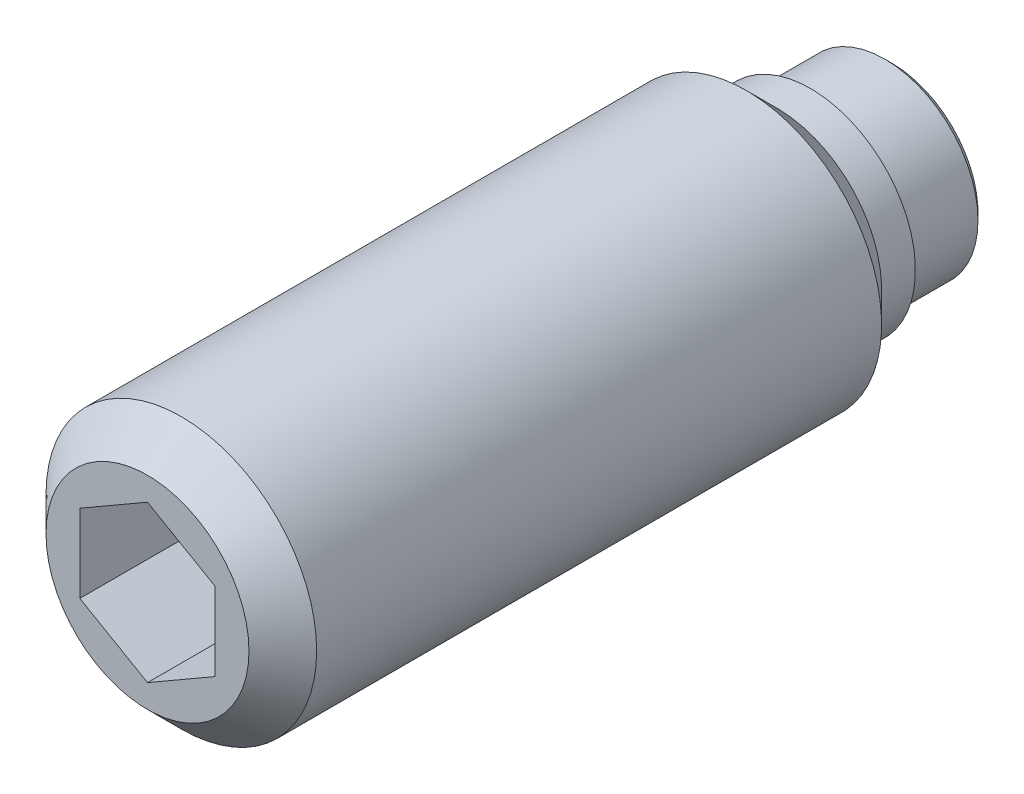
ISO-10303-21;
HEADER;
FILE_DESCRIPTION(('STEP AP214'),'2;1');
FILE_NAME('part.step','',(''),(''),'','','');
FILE_SCHEMA(('AUTOMOTIVE_DESIGN { 1 0 10303 214 1 1 1 1 }'));
ENDSEC;
DATA;
#1=APPLICATION_CONTEXT('core data for automotive mechanical design processes');
#2=APPLICATION_PROTOCOL_DEFINITION('international standard','automotive_design',2000,#1);
#3=PRODUCT_CONTEXT('',#1,'mechanical');
#4=PRODUCT('Part','Part','',(#3));
#5=PRODUCT_RELATED_PRODUCT_CATEGORY('part','',(#4));
#6=PRODUCT_DEFINITION_FORMATION('','',#4);
#7=PRODUCT_DEFINITION_CONTEXT('part definition',#1,'design');
#8=PRODUCT_DEFINITION('design','',#6,#7);
#9=PRODUCT_DEFINITION_SHAPE('','',#8);
#10=(LENGTH_UNIT() NAMED_UNIT(*) SI_UNIT(.MILLI.,.METRE.));
#11=(NAMED_UNIT(*) PLANE_ANGLE_UNIT() SI_UNIT($,.RADIAN.));
#12=(NAMED_UNIT(*) SI_UNIT($,.STERADIAN.) SOLID_ANGLE_UNIT());
#13=UNCERTAINTY_MEASURE_WITH_UNIT(LENGTH_MEASURE(1.E-05),#10,'distance_accuracy_value','');
#14=(GEOMETRIC_REPRESENTATION_CONTEXT(3) GLOBAL_UNCERTAINTY_ASSIGNED_CONTEXT((#13)) GLOBAL_UNIT_ASSIGNED_CONTEXT((#10,
#11,#12)) REPRESENTATION_CONTEXT('',''));
#15=CARTESIAN_POINT('',(0.,0.,0.));
#16=DIRECTION('',(0.,0.,1.));
#17=DIRECTION('',(1.,0.,0.));
#18=AXIS2_PLACEMENT_3D('',#15,#16,#17);
#19=CARTESIAN_POINT('',(0.,3.1,2.4));
#20=DIRECTION('',(0.,0.,1.));
#21=DIRECTION('',(1.,0.,0.));
#22=AXIS2_PLACEMENT_3D('',#19,#20,#21);
#23=PLANE('',#22);
#24=CARTESIAN_POINT('',(0.,0.,2.4));
#25=DIRECTION('',(0.,0.,-1.));
#26=DIRECTION('',(-1.,0.,0.));
#27=AXIS2_PLACEMENT_3D('',#24,#25,#26);
#28=CIRCLE('',#27,2.75);
#29=CARTESIAN_POINT('',(-2.75,0.,2.4));
#30=VERTEX_POINT('',#29);
#31=EDGE_CURVE('E130',#30,#30,#28,.T.);
#32=ORIENTED_EDGE('',*,*,#31,.F.);
#33=EDGE_LOOP('',(#32));
#34=FACE_BOUND('',#33,.T.);
#35=CARTESIAN_POINT('',(0.,0.,2.4));
#36=DIRECTION('',(0.,0.,-1.));
#37=DIRECTION('',(-1.,0.,0.));
#38=AXIS2_PLACEMENT_3D('',#35,#36,#37);
#39=CIRCLE('',#38,3.1);
#40=CARTESIAN_POINT('',(-3.1,0.,2.4));
#41=VERTEX_POINT('',#40);
#42=EDGE_CURVE('E133',#41,#41,#39,.T.);
#43=ORIENTED_EDGE('',*,*,#42,.T.);
#44=EDGE_LOOP('',(#43));
#45=FACE_BOUND('',#44,.T.);
#46=ADVANCED_FACE('F14',(#34,#45),#23,.F.);
#47=CARTESIAN_POINT('',(0.,0.,2.4));
#48=DIRECTION('',(0.,0.,-1.));
#49=DIRECTION('',(-1.,0.,0.));
#50=AXIS2_PLACEMENT_3D('',#47,#48,#49);
#51=CYLINDRICAL_SURFACE('',#50,4.);
#52=CARTESIAN_POINT('',(0.,0.,21.));
#53=DIRECTION('',(0.,0.,1.));
#54=DIRECTION('',(1.,0.,0.));
#55=AXIS2_PLACEMENT_3D('',#52,#53,#54);
#56=CIRCLE('',#55,4.);
#57=CARTESIAN_POINT('',(4.,0.,21.));
#58=VERTEX_POINT('',#57);
#59=EDGE_CURVE('E9',#58,#58,#56,.F.);
#60=ORIENTED_EDGE('',*,*,#59,.T.);
#61=EDGE_LOOP('',(#60));
#62=FACE_BOUND('',#61,.T.);
#63=CARTESIAN_POINT('',(0.,0.,4.3));
#64=DIRECTION('',(0.,0.,-1.));
#65=DIRECTION('',(-1.,0.,0.));
#66=AXIS2_PLACEMENT_3D('',#63,#64,#65);
#67=CIRCLE('',#66,4.);
#68=CARTESIAN_POINT('',(-4.,0.,4.3));
#69=VERTEX_POINT('',#68);
#70=EDGE_CURVE('E139',#69,#69,#67,.T.);
#71=ORIENTED_EDGE('',*,*,#70,.F.);
#72=EDGE_LOOP('',(#71));
#73=FACE_BOUND('',#72,.T.);
#74=ADVANCED_FACE('F157',(#62,#73),#51,.T.);
#75=CARTESIAN_POINT('',(0.,0.,4.3));
#76=DIRECTION('',(0.,0.,1.));
#77=DIRECTION('',(1.,0.,0.));
#78=AXIS2_PLACEMENT_3D('',#75,#76,#77);
#79=CONICAL_SURFACE('',#78,4.,0.785398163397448);
#80=CARTESIAN_POINT('',(0.,0.,3.4));
#81=DIRECTION('',(0.,0.,-1.));
#82=DIRECTION('',(-1.,0.,0.));
#83=AXIS2_PLACEMENT_3D('',#80,#81,#82);
#84=CIRCLE('',#83,3.1);
#85=CARTESIAN_POINT('',(-3.1,0.,3.4));
#86=VERTEX_POINT('',#85);
#87=EDGE_CURVE('E136',#86,#86,#84,.T.);
#88=ORIENTED_EDGE('',*,*,#87,.F.);
#89=EDGE_LOOP('',(#88));
#90=FACE_BOUND('',#89,.T.);
#91=ORIENTED_EDGE('',*,*,#70,.T.);
#92=EDGE_LOOP('',(#91));
#93=FACE_BOUND('',#92,.T.);
#94=ADVANCED_FACE('F164',(#90,#93),#79,.T.);
#95=CARTESIAN_POINT('',(0.,0.,2.4));
#96=DIRECTION('',(0.,0.,-1.));
#97=DIRECTION('',(-1.,0.,0.));
#98=AXIS2_PLACEMENT_3D('',#95,#96,#97);
#99=CYLINDRICAL_SURFACE('',#98,3.1);
#100=ORIENTED_EDGE('',*,*,#42,.F.);
#101=EDGE_LOOP('',(#100));
#102=FACE_BOUND('',#101,.T.);
#103=ORIENTED_EDGE('',*,*,#87,.T.);
#104=EDGE_LOOP('',(#103));
#105=FACE_BOUND('',#104,.T.);
#106=ADVANCED_FACE('F172',(#102,#105),#99,.T.);
#107=CARTESIAN_POINT('',(0.,0.,-1.));
#108=DIRECTION('',(0.,0.,-1.));
#109=DIRECTION('',(-1.,0.,0.));
#110=AXIS2_PLACEMENT_3D('',#107,#108,#109);
#111=CYLINDRICAL_SURFACE('',#110,2.75);
#112=CARTESIAN_POINT('',(0.,0.,0.2));
#113=DIRECTION('',(0.,0.,-1.));
#114=DIRECTION('',(-1.,0.,0.));
#115=AXIS2_PLACEMENT_3D('',#112,#113,#114);
#116=CIRCLE('',#115,2.75);
#117=CARTESIAN_POINT('',(-2.75,0.,0.2));
#118=VERTEX_POINT('',#117);
#119=EDGE_CURVE('E127',#118,#118,#116,.T.);
#120=ORIENTED_EDGE('',*,*,#119,.F.);
#121=EDGE_LOOP('',(#120));
#122=FACE_BOUND('',#121,.T.);
#123=ORIENTED_EDGE('',*,*,#31,.T.);
#124=EDGE_LOOP('',(#123));
#125=FACE_BOUND('',#124,.T.);
#126=ADVANCED_FACE('F170',(#122,#125),#111,.T.);
#127=CARTESIAN_POINT('',(0.,0.,0.2));
#128=DIRECTION('',(0.,0.,1.));
#129=DIRECTION('',(1.,0.,0.));
#130=AXIS2_PLACEMENT_3D('',#127,#128,#129);
#131=CONICAL_SURFACE('',#130,2.75,0.785398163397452);
#132=CARTESIAN_POINT('',(0.,0.,0.));
#133=DIRECTION('',(0.,0.,-1.));
#134=DIRECTION('',(-1.,0.,0.));
#135=AXIS2_PLACEMENT_3D('',#132,#133,#134);
#136=CIRCLE('',#135,2.55);
#137=CARTESIAN_POINT('',(-2.55,0.,0.));
#138=VERTEX_POINT('',#137);
#139=EDGE_CURVE('E124',#138,#138,#136,.T.);
#140=ORIENTED_EDGE('',*,*,#139,.F.);
#141=EDGE_LOOP('',(#140));
#142=FACE_BOUND('',#141,.T.);
#143=ORIENTED_EDGE('',*,*,#119,.T.);
#144=EDGE_LOOP('',(#143));
#145=FACE_BOUND('',#144,.T.);
#146=ADVANCED_FACE('F204',(#142,#145),#131,.T.);
#147=CARTESIAN_POINT('',(0.,2.55,0.));
#148=DIRECTION('',(0.,0.,1.));
#149=DIRECTION('',(1.,0.,0.));
#150=AXIS2_PLACEMENT_3D('',#147,#148,#149);
#151=PLANE('',#150);
#152=CARTESIAN_POINT('',(0.,0.,0.));
#153=DIRECTION('',(0.,0.,-1.));
#154=DIRECTION('',(-1.,0.,0.));
#155=AXIS2_PLACEMENT_3D('',#152,#153,#154);
#156=CIRCLE('',#155,1.);
#157=CARTESIAN_POINT('',(-1.,0.,0.));
#158=VERTEX_POINT('',#157);
#159=EDGE_CURVE('E114',#158,#158,#156,.T.);
#160=ORIENTED_EDGE('',*,*,#159,.F.);
#161=EDGE_LOOP('',(#160));
#162=FACE_BOUND('',#161,.T.);
#163=ORIENTED_EDGE('',*,*,#139,.T.);
#164=EDGE_LOOP('',(#163));
#165=FACE_BOUND('',#164,.T.);
#166=ADVANCED_FACE('F212',(#162,#165),#151,.F.);
#167=CARTESIAN_POINT('',(0.,0.,0.));
#168=DIRECTION('',(0.,0.,1.));
#169=DIRECTION('',(1.,0.,0.));
#170=AXIS2_PLACEMENT_3D('',#167,#168,#169);
#171=CONICAL_SURFACE('',#170,1.,0.785398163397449);
#172=CARTESIAN_POINT('',(0.,0.,-1.));
#173=VERTEX_POINT('',#172);
#174=VERTEX_LOOP('',#173);
#175=FACE_BOUND('',#174,.T.);
#176=ORIENTED_EDGE('',*,*,#159,.T.);
#177=EDGE_LOOP('',(#176));
#178=FACE_BOUND('',#177,.T.);
#179=ADVANCED_FACE('F220',(#175,#178),#171,.T.);
#180=CARTESIAN_POINT('',(0.,0.,22.));
#181=DIRECTION('',(0.,0.,1.));
#182=DIRECTION('',(1.,0.,0.));
#183=AXIS2_PLACEMENT_3D('',#180,#181,#182);
#184=PLANE('',#183);
#185=CARTESIAN_POINT('',(0.,0.,22.));
#186=DIRECTION('',(0.,0.,1.));
#187=DIRECTION('',(1.,0.,0.));
#188=AXIS2_PLACEMENT_3D('',#185,#186,#187);
#189=CIRCLE('',#188,3.);
#190=CARTESIAN_POINT('',(3.,0.,22.));
#191=VERTEX_POINT('',#190);
#192=EDGE_CURVE('E22',#191,#191,#189,.T.);
#193=ORIENTED_EDGE('',*,*,#192,.T.);
#194=EDGE_LOOP('',(#193));
#195=FACE_BOUND('',#194,.T.);
#196=DIRECTION('',(-0.866025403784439,0.5,0.));
#197=VECTOR('',#196,1.);
#198=CARTESIAN_POINT('',(2.,1.15470053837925,22.));
#199=LINE('',#198,#197);
#200=CARTESIAN_POINT('',(2.,1.15470053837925,22.));
#201=VERTEX_POINT('',#200);
#202=CARTESIAN_POINT('',(0.,2.30940107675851,22.));
#203=VERTEX_POINT('',#202);
#204=EDGE_CURVE('E29',#201,#203,#199,.T.);
#205=ORIENTED_EDGE('',*,*,#204,.F.);
#206=DIRECTION('',(0.,1.,0.));
#207=VECTOR('',#206,1.);
#208=CARTESIAN_POINT('',(2.,-1.15470053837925,22.));
#209=LINE('',#208,#207);
#210=CARTESIAN_POINT('',(2.,-1.15470053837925,22.));
#211=VERTEX_POINT('',#210);
#212=EDGE_CURVE('E88',#211,#201,#209,.T.);
#213=ORIENTED_EDGE('',*,*,#212,.F.);
#214=DIRECTION('',(0.866025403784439,0.5,0.));
#215=VECTOR('',#214,1.);
#216=CARTESIAN_POINT('',(0.,-2.30940107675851,22.));
#217=LINE('',#216,#215);
#218=CARTESIAN_POINT('',(0.,-2.30940107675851,22.));
#219=VERTEX_POINT('',#218);
#220=EDGE_CURVE('E91',#219,#211,#217,.T.);
#221=ORIENTED_EDGE('',*,*,#220,.F.);
#222=DIRECTION('',(0.866025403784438,-0.5,0.));
#223=VECTOR('',#222,1.);
#224=CARTESIAN_POINT('',(-2.,-1.15470053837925,22.));
#225=LINE('',#224,#223);
#226=CARTESIAN_POINT('',(-2.,-1.15470053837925,22.));
#227=VERTEX_POINT('',#226);
#228=EDGE_CURVE('E107',#227,#219,#225,.T.);
#229=ORIENTED_EDGE('',*,*,#228,.F.);
#230=DIRECTION('',(0.,-1.,0.));
#231=VECTOR('',#230,1.);
#232=CARTESIAN_POINT('',(-2.,1.15470053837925,22.));
#233=LINE('',#232,#231);
#234=CARTESIAN_POINT('',(-2.,1.15470053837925,22.));
#235=VERTEX_POINT('',#234);
#236=EDGE_CURVE('E104',#235,#227,#233,.T.);
#237=ORIENTED_EDGE('',*,*,#236,.F.);
#238=DIRECTION('',(-0.866025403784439,-0.5,0.));
#239=VECTOR('',#238,1.);
#240=CARTESIAN_POINT('',(0.,2.30940107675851,22.));
#241=LINE('',#240,#239);
#242=EDGE_CURVE('E102',#203,#235,#241,.T.);
#243=ORIENTED_EDGE('',*,*,#242,.F.);
#244=EDGE_LOOP('',(#205,#213,#221,#229,#237,#243));
#245=FACE_BOUND('',#244,.T.);
#246=ADVANCED_FACE('F144',(#195,#245),#184,.T.);
#247=CARTESIAN_POINT('',(2.,1.15470053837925,18.));
#248=DIRECTION('',(0.5,0.866025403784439,0.));
#249=DIRECTION('',(-0.866025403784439,0.5,0.));
#250=AXIS2_PLACEMENT_3D('',#247,#248,#249);
#251=PLANE('',#250);
#252=ORIENTED_EDGE('',*,*,#204,.T.);
#253=DIRECTION('',(0.,0.,1.));
#254=VECTOR('',#253,1.);
#255=CARTESIAN_POINT('',(0.,2.30940107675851,18.));
#256=LINE('',#255,#254);
#257=CARTESIAN_POINT('',(0.,2.30940107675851,18.));
#258=VERTEX_POINT('',#257);
#259=EDGE_CURVE('E65',#258,#203,#256,.T.);
#260=ORIENTED_EDGE('',*,*,#259,.F.);
#261=DIRECTION('',(-0.866025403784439,0.5,0.));
#262=VECTOR('',#261,1.);
#263=CARTESIAN_POINT('',(2.,1.15470053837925,18.));
#264=LINE('',#263,#262);
#265=CARTESIAN_POINT('',(2.,1.15470053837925,18.));
#266=VERTEX_POINT('',#265);
#267=EDGE_CURVE('E69',#266,#258,#264,.T.);
#268=ORIENTED_EDGE('',*,*,#267,.F.);
#269=DIRECTION('',(0.,0.,1.));
#270=VECTOR('',#269,1.);
#271=CARTESIAN_POINT('',(2.,1.15470053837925,18.));
#272=LINE('',#271,#270);
#273=EDGE_CURVE('E112',#266,#201,#272,.T.);
#274=ORIENTED_EDGE('',*,*,#273,.T.);
#275=EDGE_LOOP('',(#252,#260,#268,#274));
#276=FACE_BOUND('',#275,.T.);
#277=ADVANCED_FACE('F67',(#276),#251,.F.);
#278=CARTESIAN_POINT('',(2.,-1.15470053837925,18.));
#279=DIRECTION('',(1.,0.,0.));
#280=DIRECTION('',(0.,0.,-1.));
#281=AXIS2_PLACEMENT_3D('',#278,#279,#280);
#282=PLANE('',#281);
#283=ORIENTED_EDGE('',*,*,#212,.T.);
#284=ORIENTED_EDGE('',*,*,#273,.F.);
#285=DIRECTION('',(0.,1.,0.));
#286=VECTOR('',#285,1.);
#287=CARTESIAN_POINT('',(2.,-1.15470053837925,18.));
#288=LINE('',#287,#286);
#289=CARTESIAN_POINT('',(2.,-1.15470053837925,18.));
#290=VERTEX_POINT('',#289);
#291=EDGE_CURVE('E75',#290,#266,#288,.T.);
#292=ORIENTED_EDGE('',*,*,#291,.F.);
#293=DIRECTION('',(0.,0.,1.));
#294=VECTOR('',#293,1.);
#295=CARTESIAN_POINT('',(2.,-1.15470053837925,18.));
#296=LINE('',#295,#294);
#297=EDGE_CURVE('E115',#290,#211,#296,.T.);
#298=ORIENTED_EDGE('',*,*,#297,.T.);
#299=EDGE_LOOP('',(#283,#284,#292,#298));
#300=FACE_BOUND('',#299,.T.);
#301=ADVANCED_FACE('F243',(#300),#282,.F.);
#302=CARTESIAN_POINT('',(0.,-2.30940107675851,18.));
#303=DIRECTION('',(0.5,-0.866025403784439,0.));
#304=DIRECTION('',(0.866025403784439,0.5,0.));
#305=AXIS2_PLACEMENT_3D('',#302,#303,#304);
#306=PLANE('',#305);
#307=ORIENTED_EDGE('',*,*,#220,.T.);
#308=ORIENTED_EDGE('',*,*,#297,.F.);
#309=DIRECTION('',(0.866025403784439,0.5,0.));
#310=VECTOR('',#309,1.);
#311=CARTESIAN_POINT('',(0.,-2.30940107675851,18.));
#312=LINE('',#311,#310);
#313=CARTESIAN_POINT('',(0.,-2.30940107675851,18.));
#314=VERTEX_POINT('',#313);
#315=EDGE_CURVE('E98',#314,#290,#312,.T.);
#316=ORIENTED_EDGE('',*,*,#315,.F.);
#317=DIRECTION('',(0.,0.,1.));
#318=VECTOR('',#317,1.);
#319=CARTESIAN_POINT('',(0.,-2.30940107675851,18.));
#320=LINE('',#319,#318);
#321=EDGE_CURVE('E117',#314,#219,#320,.T.);
#322=ORIENTED_EDGE('',*,*,#321,.T.);
#323=EDGE_LOOP('',(#307,#308,#316,#322));
#324=FACE_BOUND('',#323,.T.);
#325=ADVANCED_FACE('F251',(#324),#306,.F.);
#326=CARTESIAN_POINT('',(-2.,-1.15470053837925,18.));
#327=DIRECTION('',(-0.5,-0.866025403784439,0.));
#328=DIRECTION('',(0.866025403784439,-0.5,0.));
#329=AXIS2_PLACEMENT_3D('',#326,#327,#328);
#330=PLANE('',#329);
#331=ORIENTED_EDGE('',*,*,#228,.T.);
#332=ORIENTED_EDGE('',*,*,#321,.F.);
#333=DIRECTION('',(0.866025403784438,-0.5,0.));
#334=VECTOR('',#333,1.);
#335=CARTESIAN_POINT('',(-2.,-1.15470053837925,18.));
#336=LINE('',#335,#334);
#337=CARTESIAN_POINT('',(-2.,-1.15470053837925,18.));
#338=VERTEX_POINT('',#337);
#339=EDGE_CURVE('E95',#338,#314,#336,.T.);
#340=ORIENTED_EDGE('',*,*,#339,.F.);
#341=DIRECTION('',(0.,0.,1.));
#342=VECTOR('',#341,1.);
#343=CARTESIAN_POINT('',(-2.,-1.15470053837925,18.));
#344=LINE('',#343,#342);
#345=EDGE_CURVE('E119',#338,#227,#344,.T.);
#346=ORIENTED_EDGE('',*,*,#345,.T.);
#347=EDGE_LOOP('',(#331,#332,#340,#346));
#348=FACE_BOUND('',#347,.T.);
#349=ADVANCED_FACE('F260',(#348),#330,.F.);
#350=CARTESIAN_POINT('',(-2.,1.15470053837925,18.));
#351=DIRECTION('',(-1.,0.,0.));
#352=DIRECTION('',(0.,0.,1.));
#353=AXIS2_PLACEMENT_3D('',#350,#351,#352);
#354=PLANE('',#353);
#355=ORIENTED_EDGE('',*,*,#236,.T.);
#356=ORIENTED_EDGE('',*,*,#345,.F.);
#357=DIRECTION('',(0.,-1.,0.));
#358=VECTOR('',#357,1.);
#359=CARTESIAN_POINT('',(-2.,1.15470053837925,18.));
#360=LINE('',#359,#358);
#361=CARTESIAN_POINT('',(-2.,1.15470053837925,18.));
#362=VERTEX_POINT('',#361);
#363=EDGE_CURVE('E83',#362,#338,#360,.T.);
#364=ORIENTED_EDGE('',*,*,#363,.F.);
#365=DIRECTION('',(0.,0.,1.));
#366=VECTOR('',#365,1.);
#367=CARTESIAN_POINT('',(-2.,1.15470053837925,18.));
#368=LINE('',#367,#366);
#369=EDGE_CURVE('E74',#362,#235,#368,.T.);
#370=ORIENTED_EDGE('',*,*,#369,.T.);
#371=EDGE_LOOP('',(#355,#356,#364,#370));
#372=FACE_BOUND('',#371,.T.);
#373=ADVANCED_FACE('F269',(#372),#354,.F.);
#374=CARTESIAN_POINT('',(0.,2.30940107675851,18.));
#375=DIRECTION('',(-0.5,0.866025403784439,0.));
#376=DIRECTION('',(-0.866025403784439,-0.5,0.));
#377=AXIS2_PLACEMENT_3D('',#374,#375,#376);
#378=PLANE('',#377);
#379=ORIENTED_EDGE('',*,*,#242,.T.);
#380=ORIENTED_EDGE('',*,*,#369,.F.);
#381=DIRECTION('',(-0.866025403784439,-0.5,0.));
#382=VECTOR('',#381,1.);
#383=CARTESIAN_POINT('',(0.,2.30940107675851,18.));
#384=LINE('',#383,#382);
#385=EDGE_CURVE('E78',#258,#362,#384,.T.);
#386=ORIENTED_EDGE('',*,*,#385,.F.);
#387=ORIENTED_EDGE('',*,*,#259,.T.);
#388=EDGE_LOOP('',(#379,#380,#386,#387));
#389=FACE_BOUND('',#388,.T.);
#390=ADVANCED_FACE('F79',(#389),#378,.F.);
#391=CARTESIAN_POINT('',(0.,0.,18.));
#392=DIRECTION('',(0.,0.,1.));
#393=DIRECTION('',(1.,0.,0.));
#394=AXIS2_PLACEMENT_3D('',#391,#392,#393);
#395=PLANE('',#394);
#396=ORIENTED_EDGE('',*,*,#267,.T.);
#397=ORIENTED_EDGE('',*,*,#385,.T.);
#398=ORIENTED_EDGE('',*,*,#363,.T.);
#399=ORIENTED_EDGE('',*,*,#339,.T.);
#400=ORIENTED_EDGE('',*,*,#315,.T.);
#401=ORIENTED_EDGE('',*,*,#291,.T.);
#402=EDGE_LOOP('',(#396,#397,#398,#399,#400,#401));
#403=FACE_BOUND('',#402,.T.);
#404=ADVANCED_FACE('F85',(#403),#395,.T.);
#405=CARTESIAN_POINT('',(0.,0.,22.));
#406=DIRECTION('',(0.,0.,-1.));
#407=DIRECTION('',(-1.,0.,0.));
#408=AXIS2_PLACEMENT_3D('',#405,#406,#407);
#409=CONICAL_SURFACE('',#408,3.,0.785398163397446);
#410=ORIENTED_EDGE('',*,*,#59,.F.);
#411=EDGE_LOOP('',(#410));
#412=FACE_BOUND('',#411,.T.);
#413=ORIENTED_EDGE('',*,*,#192,.F.);
#414=EDGE_LOOP('',(#413));
#415=FACE_BOUND('',#414,.T.);
#416=ADVANCED_FACE('F16',(#412,#415),#409,.T.);
#417=CLOSED_SHELL('',(#46,#74,#94,#106,#126,#146,#166,#179,#246,#277,#301,#325,#349,#373,#390,
#404,#416));
#418=MANIFOLD_SOLID_BREP('B1',#417);
#419=ADVANCED_BREP_SHAPE_REPRESENTATION('',(#18,#418),#14);
#420=SHAPE_DEFINITION_REPRESENTATION(#9,#419);
ENDSEC;
END-ISO-10303-21;
